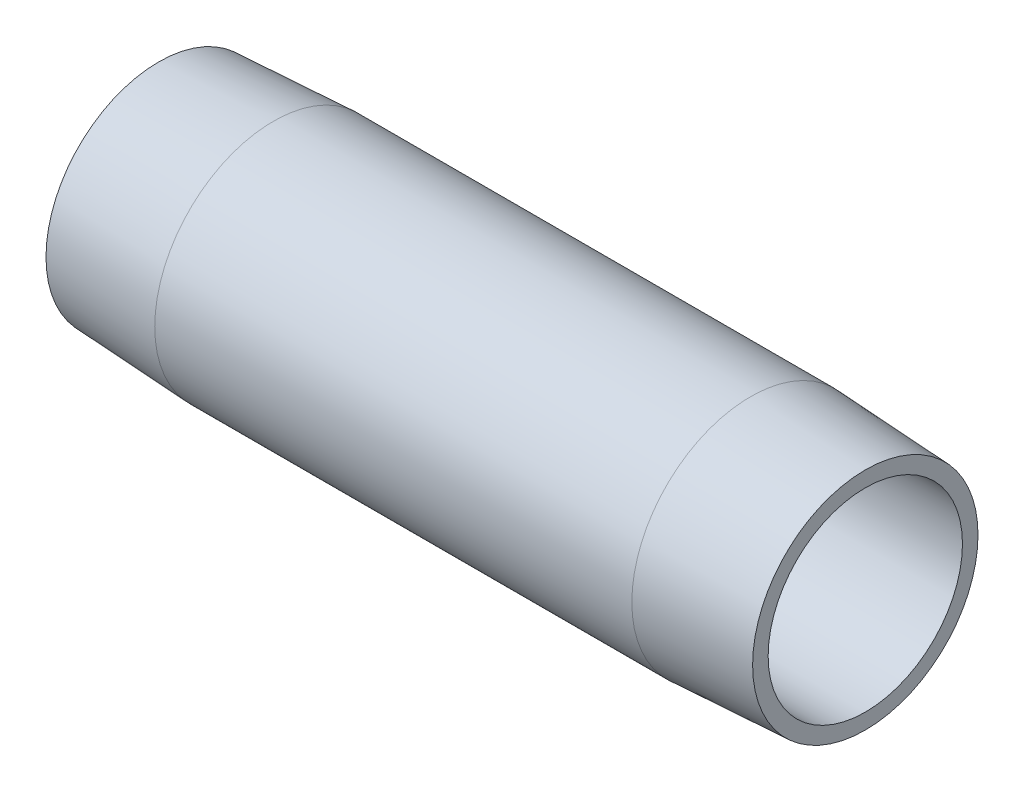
from build123d import *


with BuildPart() as part:
    # Sketch1 → Revolve1 (revolve)
    with BuildSketch(Plane.XY, mode=Mode.PRIVATE) as revolve1_sk:
        Polygon((63.5, 8.73125), (0, 8.73125), (0, 10.127550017), (10.3124, 10.668), (53.1876, 10.668), (63.5, 10.127550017), align=None)
    revolve(revolve1_sk.sketch.rotate(Axis((0, 0, 0), (1, 0, 0)), 90), axis=Axis((0, 0, 0), (1, 0, 0)))


solid = part.part
